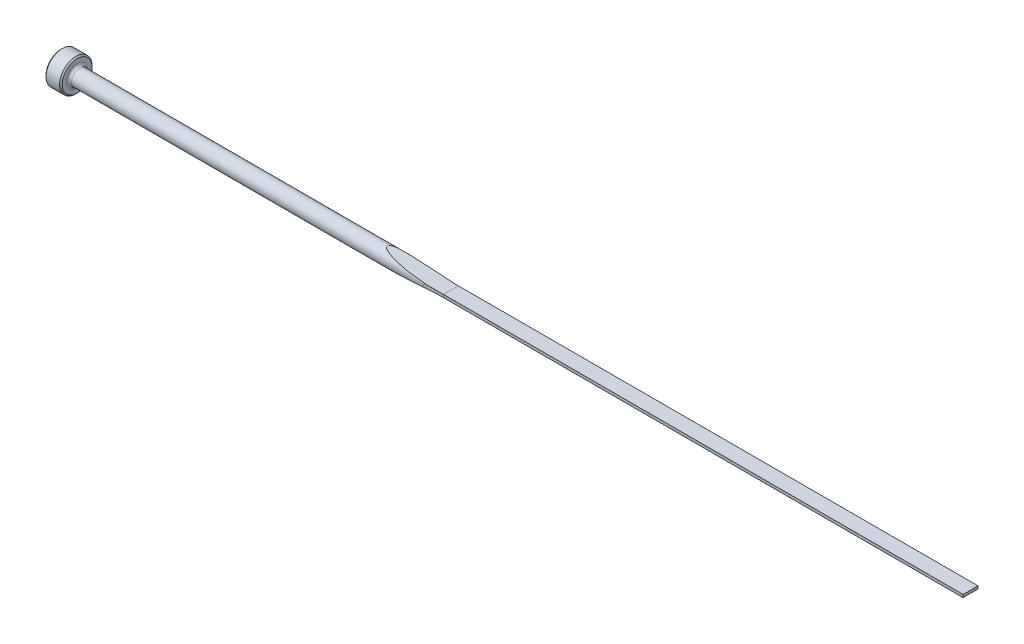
ISO-10303-21;
HEADER;
FILE_DESCRIPTION(('STEP AP214'),'2;1');
FILE_NAME('part.step','',(''),(''),'','','');
FILE_SCHEMA(('AUTOMOTIVE_DESIGN { 1 0 10303 214 1 1 1 1 }'));
ENDSEC;
DATA;
#1=APPLICATION_CONTEXT('core data for automotive mechanical design processes');
#2=APPLICATION_PROTOCOL_DEFINITION('international standard','automotive_design',2000,#1);
#3=PRODUCT_CONTEXT('',#1,'mechanical');
#4=PRODUCT('Part','Part','',(#3));
#5=PRODUCT_RELATED_PRODUCT_CATEGORY('part','',(#4));
#6=PRODUCT_DEFINITION_FORMATION('','',#4);
#7=PRODUCT_DEFINITION_CONTEXT('part definition',#1,'design');
#8=PRODUCT_DEFINITION('design','',#6,#7);
#9=PRODUCT_DEFINITION_SHAPE('','',#8);
#10=(LENGTH_UNIT() NAMED_UNIT(*) SI_UNIT(.MILLI.,.METRE.));
#11=(NAMED_UNIT(*) PLANE_ANGLE_UNIT() SI_UNIT($,.RADIAN.));
#12=(NAMED_UNIT(*) SI_UNIT($,.STERADIAN.) SOLID_ANGLE_UNIT());
#13=UNCERTAINTY_MEASURE_WITH_UNIT(LENGTH_MEASURE(1.E-05),#10,'distance_accuracy_value','');
#14=(GEOMETRIC_REPRESENTATION_CONTEXT(3) GLOBAL_UNCERTAINTY_ASSIGNED_CONTEXT((#13)) GLOBAL_UNIT_ASSIGNED_CONTEXT((#10,
#11,#12)) REPRESENTATION_CONTEXT('',''));
#15=CARTESIAN_POINT('',(0.,0.,0.));
#16=DIRECTION('',(0.,0.,1.));
#17=DIRECTION('',(1.,0.,0.));
#18=AXIS2_PLACEMENT_3D('',#15,#16,#17);
#19=CARTESIAN_POINT('',(0.,0.,0.));
#20=DIRECTION('',(-1.,0.,0.));
#21=DIRECTION('',(0.,0.,1.));
#22=AXIS2_PLACEMENT_3D('',#19,#20,#21);
#23=CYLINDRICAL_SURFACE('',#22,2.3749);
#24=CARTESIAN_POINT('',(5.5118,0.,0.));
#25=DIRECTION('',(-1.,0.,0.));
#26=DIRECTION('',(0.,0.,1.));
#27=AXIS2_PLACEMENT_3D('',#24,#25,#26);
#28=CIRCLE('',#27,2.3749);
#29=CARTESIAN_POINT('',(5.5118,0.,2.3749));
#30=VERTEX_POINT('',#29);
#31=EDGE_CURVE('E152',#30,#30,#28,.F.);
#32=ORIENTED_EDGE('',*,*,#31,.T.);
#33=EDGE_LOOP('',(#32));
#34=FACE_BOUND('',#33,.T.);
#35=CARTESIAN_POINT('',(114.3,0.931958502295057,2.18439999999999));
#36=CARTESIAN_POINT('',(114.107551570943,0.931940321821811,2.18439976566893));
#37=CARTESIAN_POINT('',(113.915101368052,0.930492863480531,2.18502490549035));
#38=CARTESIAN_POINT('',(113.530223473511,0.924611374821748,2.18752450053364));
#39=CARTESIAN_POINT('',(113.337795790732,0.920176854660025,2.18939916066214));
#40=CARTESIAN_POINT('',(112.951834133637,0.9081552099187,2.19441218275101));
#41=CARTESIAN_POINT('',(112.758300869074,0.900548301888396,2.19755847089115));
#42=CARTESIAN_POINT('',(112.371444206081,0.881895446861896,2.20511052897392));
#43=CARTESIAN_POINT('',(112.178120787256,0.87084987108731,2.20951616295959));
#44=CARTESIAN_POINT('',(111.78030053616,0.84410077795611,2.2198794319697));
#45=CARTESIAN_POINT('',(111.575821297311,0.828159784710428,2.22591363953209));
#46=CARTESIAN_POINT('',(111.167312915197,0.79103033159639,2.23937732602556));
#47=CARTESIAN_POINT('',(110.963283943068,0.7698401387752,2.24680726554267));
#48=CARTESIAN_POINT('',(110.55661740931,0.720830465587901,2.26301546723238));
#49=CARTESIAN_POINT('',(110.353977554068,0.693029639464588,2.27178991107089));
#50=CARTESIAN_POINT('',(110.051270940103,0.644172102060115,2.28592867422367));
#51=CARTESIAN_POINT('',(109.950603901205,0.626699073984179,2.29080303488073));
#52=CARTESIAN_POINT('',(109.749867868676,0.588702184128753,2.30086330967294));
#53=CARTESIAN_POINT('',(109.649798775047,0.568178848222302,2.3060491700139));
#54=CARTESIAN_POINT('',(109.501819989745,0.534634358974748,2.31396676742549));
#55=CARTESIAN_POINT('',(109.453550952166,0.523182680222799,2.31658911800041));
#56=CARTESIAN_POINT('',(109.357308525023,0.499097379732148,2.32189592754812));
#57=CARTESIAN_POINT('',(109.309335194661,0.486463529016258,2.32458039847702));
#58=CARTESIAN_POINT('',(109.166352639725,0.44658202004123,2.33269738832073));
#59=CARTESIAN_POINT('',(109.071872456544,0.417265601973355,2.33821536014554));
#60=CARTESIAN_POINT('',(108.945363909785,0.370835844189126,2.34580058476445));
#61=CARTESIAN_POINT('',(108.911833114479,0.357819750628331,2.34783049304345));
#62=CARTESIAN_POINT('',(108.845375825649,0.330089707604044,2.35189084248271));
#63=CARTESIAN_POINT('',(108.81245087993,0.315371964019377,2.35392127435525));
#64=CARTESIAN_POINT('',(108.74666492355,0.283182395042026,2.35801388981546));
#65=CARTESIAN_POINT('',(108.713839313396,0.265637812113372,2.36007502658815));
#66=CARTESIAN_POINT('',(108.650301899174,0.22709417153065,2.36409846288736));
#67=CARTESIAN_POINT('',(108.619581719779,0.206110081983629,2.36606114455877));
#68=CARTESIAN_POINT('',(108.580752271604,0.173632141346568,2.36855971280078));
#69=CARTESIAN_POINT('',(108.570653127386,0.164553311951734,2.36921145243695));
#70=CARTESIAN_POINT('',(108.551335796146,0.145453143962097,2.3704611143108));
#71=CARTESIAN_POINT('',(108.542119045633,0.135430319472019,2.3710589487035));
#72=CARTESIAN_POINT('',(108.524892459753,0.11416272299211,2.372178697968));
#73=CARTESIAN_POINT('',(108.516898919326,0.102904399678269,2.3726995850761));
#74=CARTESIAN_POINT('',(108.502963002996,0.0791761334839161,2.37360916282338));
#75=CARTESIAN_POINT('',(108.497013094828,0.0667108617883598,2.37399833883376));
#76=CARTESIAN_POINT('',(108.489549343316,0.0451214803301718,2.37448695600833));
#77=CARTESIAN_POINT('',(108.487216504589,0.0362843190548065,2.37463982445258));
#78=CARTESIAN_POINT('',(108.484070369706,0.0183429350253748,2.3748460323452));
#79=CARTESIAN_POINT('',(108.48325542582,0.00923901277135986,2.37489947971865));
#80=CARTESIAN_POINT('',(108.483239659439,-0.00898512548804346,2.37490051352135));
#81=CARTESIAN_POINT('',(108.484041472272,-0.0181053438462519,2.37484792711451));
#82=CARTESIAN_POINT('',(108.487168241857,-0.0360804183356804,2.37464298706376));
#83=CARTESIAN_POINT('',(108.489494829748,-0.0449349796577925,2.37449052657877));
#84=CARTESIAN_POINT('',(108.496426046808,-0.0650505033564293,2.37403676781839));
#85=CARTESIAN_POINT('',(108.501530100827,-0.0761364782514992,2.37370288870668));
#86=CARTESIAN_POINT('',(108.51340908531,-0.0973644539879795,2.37292722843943));
#87=CARTESIAN_POINT('',(108.520188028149,-0.10750410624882,2.3724851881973));
#88=CARTESIAN_POINT('',(108.54065261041,-0.134467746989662,2.37115359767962));
#89=CARTESIAN_POINT('',(108.555594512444,-0.150320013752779,2.37018436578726));
#90=CARTESIAN_POINT('',(108.587463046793,-0.179846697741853,2.36812651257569));
#91=CARTESIAN_POINT('',(108.604395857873,-0.193514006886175,2.36703752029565));
#92=CARTESIAN_POINT('',(108.650005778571,-0.226993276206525,2.36411848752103));
#93=CARTESIAN_POINT('',(108.679601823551,-0.245533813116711,2.36223795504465));
#94=CARTESIAN_POINT('',(108.740349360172,-0.279898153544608,2.35841043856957));
#95=CARTESIAN_POINT('',(108.771504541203,-0.295715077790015,2.35646330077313));
#96=CARTESIAN_POINT('',(108.866609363,-0.340418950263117,2.35057165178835));
#97=CARTESIAN_POINT('',(108.931917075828,-0.366382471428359,2.34659497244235));
#98=CARTESIAN_POINT('',(109.074178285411,-0.417382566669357,2.33809504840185));
#99=CARTESIAN_POINT('',(109.151384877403,-0.441669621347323,2.33358126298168));
#100=CARTESIAN_POINT('',(109.306961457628,-0.486276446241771,2.32469268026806));
#101=CARTESIAN_POINT('',(109.385331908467,-0.506594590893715,2.32031794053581));
#102=CARTESIAN_POINT('',(109.621843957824,-0.563416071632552,2.30743335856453));
#103=CARTESIAN_POINT('',(109.78100645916,-0.59566591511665,2.2991859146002));
#104=CARTESIAN_POINT('',(110.100573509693,-0.653182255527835,2.28349651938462));
#105=CARTESIAN_POINT('',(110.260978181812,-0.678448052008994,2.27605464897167));
#106=CARTESIAN_POINT('',(110.582316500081,-0.723854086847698,2.26202300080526));
#107=CARTESIAN_POINT('',(110.743249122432,-0.744001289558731,2.25543207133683));
#108=CARTESIAN_POINT('',(111.168696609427,-0.79200356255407,2.23917011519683));
#109=CARTESIAN_POINT('',(111.433609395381,-0.816543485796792,2.23022625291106));
#110=CARTESIAN_POINT('',(111.964238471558,-0.85775890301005,2.21469349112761));
#111=CARTESIAN_POINT('',(112.229955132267,-0.874429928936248,2.20810593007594));
#112=CARTESIAN_POINT('',(112.761270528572,-0.901186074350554,2.19732116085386));
#113=CARTESIAN_POINT('',(113.026868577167,-0.911283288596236,2.19311956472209));
#114=CARTESIAN_POINT('',(113.558248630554,-0.925643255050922,2.18709742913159));
#115=CARTESIAN_POINT('',(113.82403063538,-0.929906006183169,2.18527689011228));
#116=CARTESIAN_POINT('',(114.159882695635,-0.931763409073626,2.18448280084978));
#117=CARTESIAN_POINT('',(114.229941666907,-0.931956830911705,2.18439997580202));
#118=CARTESIAN_POINT('',(114.3,-0.931958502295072,2.18439999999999));
#119=B_SPLINE_CURVE_WITH_KNOTS('',3,(#35,#36,#37,#38,#39,#40,#41,#42,#43,#44,#45,#46,#47,#48,
#49,#50,#51,#52,#53,#54,#55,#56,#57,#58,#59,#60,#61,#62,#63,#64,#65,#66,#67,#68,#69,#70,#71,#72,
#73,#74,#75,#76,#77,#78,#79,#80,#81,#82,#83,#84,#85,#86,#87,#88,#89,#90,#91,#92,#93,#94,#95,#96,
#97,#98,#99,#100,#101,#102,#103,#104,#105,#106,#107,#108,#109,#110,#111,#112,#113,#114,#115,
#116,#117,#118),.UNSPECIFIED.,.F.,.F.,(4,2,2,2,2,2,2,2,2,2,2,2,2,2,2,2,2,2,2,2,2,2,2,2,2,2,2,2,
2,2,2,2,2,2,2,2,2,2,2,2,2,4),(0.,0.577341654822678,1.15477801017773,1.73587049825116,
2.31690027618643,2.93240275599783,3.54810870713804,4.16209742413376,4.46893047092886,
4.77571068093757,4.9247288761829,5.07377599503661,5.37061535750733,5.47866452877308,
5.58695943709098,5.69870175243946,5.80997010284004,5.85071283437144,5.89152080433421,
5.93283229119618,5.97398983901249,6.00129967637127,6.02857985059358,6.05590452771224,
6.08325848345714,6.11967760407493,6.15618483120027,6.22123367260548,6.2864900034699,
6.39114062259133,6.49605180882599,6.70686384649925,6.94992813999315,7.19309177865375,
7.68061293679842,8.16818297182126,8.65508602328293,9.45349626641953,10.2523593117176,
11.0497483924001,11.8471376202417,12.0573140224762),.UNSPECIFIED.);
#120=CARTESIAN_POINT('',(109.50710742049,0.535694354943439,2.31369435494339));
#121=VERTEX_POINT('',#120);
#122=CARTESIAN_POINT('',(109.50710742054,-0.535694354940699,2.31369435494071));
#123=VERTEX_POINT('',#122);
#124=EDGE_CURVE('E155',#121,#123,#119,.T.);
#125=ORIENTED_EDGE('',*,*,#124,.F.);
#126=CARTESIAN_POINT('',(114.3,0.406400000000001,2.33986945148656));
#127=CARTESIAN_POINT('',(113.904416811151,0.406399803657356,2.33984948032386));
#128=CARTESIAN_POINT('',(113.508833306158,0.409040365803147,2.33941010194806));
#129=CARTESIAN_POINT('',(112.717723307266,0.419601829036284,2.33754961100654));
#130=CARTESIAN_POINT('',(112.322196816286,0.427522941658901,2.33612845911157));
#131=CARTESIAN_POINT('',(111.530447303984,0.448666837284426,2.33215725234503));
#132=CARTESIAN_POINT('',(111.134224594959,0.461900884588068,2.32960479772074));
#133=CARTESIAN_POINT('',(110.342017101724,0.493667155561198,2.32308149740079));
#134=CARTESIAN_POINT('',(109.946032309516,0.51219918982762,2.31911070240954));
#135=CARTESIAN_POINT('',(109.15352022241,0.554602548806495,2.30933764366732));
#136=CARTESIAN_POINT('',(108.756993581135,0.578485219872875,2.30353147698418));
#137=CARTESIAN_POINT('',(107.964337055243,0.631560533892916,2.28954911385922));
#138=CARTESIAN_POINT('',(107.568207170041,0.660753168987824,2.28137292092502));
#139=CARTESIAN_POINT('',(106.776306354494,0.724449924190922,2.26195322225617));
#140=CARTESIAN_POINT('',(106.380535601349,0.758955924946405,2.25070862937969));
#141=CARTESIAN_POINT('',(105.589626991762,0.833256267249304,2.22427297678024));
#142=CARTESIAN_POINT('',(105.194489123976,0.873050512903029,2.20908198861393));
#143=CARTESIAN_POINT('',(104.405319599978,0.957870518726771,2.17364869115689));
#144=CARTESIAN_POINT('',(104.011287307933,1.00289202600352,2.15341047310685));
#145=CARTESIAN_POINT('',(103.224249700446,1.09815278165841,2.10642646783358));
#146=CARTESIAN_POINT('',(102.831244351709,1.14839185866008,2.07968089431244));
#147=CARTESIAN_POINT('',(102.046799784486,1.25399752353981,2.01777261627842));
#148=CARTESIAN_POINT('',(101.655359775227,1.30936105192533,1.98261491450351));
#149=CARTESIAN_POINT('',(101.069666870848,1.39617734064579,1.92147807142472));
#150=CARTESIAN_POINT('',(100.874692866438,1.42574258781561,1.8997007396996));
#151=CARTESIAN_POINT('',(100.485332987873,1.48610747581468,1.85286228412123));
#152=CARTESIAN_POINT('',(100.290947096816,1.51690708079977,1.82780125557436));
#153=CARTESIAN_POINT('',(99.9027972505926,1.57972659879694,1.77379004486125));
#154=CARTESIAN_POINT('',(99.7090337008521,1.61174718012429,1.74483771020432));
#155=CARTESIAN_POINT('',(99.3224234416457,1.67694930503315,1.68227119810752));
#156=CARTESIAN_POINT('',(99.1295768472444,1.71013099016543,1.64865645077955));
#157=CARTESIAN_POINT('',(98.7454982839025,1.77751664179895,1.57576815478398));
#158=CARTESIAN_POINT('',(98.5542640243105,1.81171864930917,1.53650495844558));
#159=CARTESIAN_POINT('',(98.1736080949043,1.88107830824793,1.45077652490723));
#160=CARTESIAN_POINT('',(97.9841859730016,1.91623571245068,1.40431313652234));
#161=CARTESIAN_POINT('',(97.6545415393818,1.9785150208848,1.3144663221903));
#162=CARTESIAN_POINT('',(97.5137260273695,2.00547620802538,1.27315803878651));
#163=CARTESIAN_POINT('',(97.2340568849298,2.05971596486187,1.18342755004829));
#164=CARTESIAN_POINT('',(97.0952077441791,2.08699506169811,1.1349912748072));
#165=CARTESIAN_POINT('',(96.8903441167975,2.12774040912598,1.05533759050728));
#166=CARTESIAN_POINT('',(96.8229205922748,2.14123294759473,1.02775945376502));
#167=CARTESIAN_POINT('',(96.6893070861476,2.16812981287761,0.969737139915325));
#168=CARTESIAN_POINT('',(96.6231168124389,2.18153416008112,0.939293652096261));
#169=CARTESIAN_POINT('',(96.4926184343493,2.20811308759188,0.874982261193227));
#170=CARTESIAN_POINT('',(96.4283052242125,2.22128824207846,0.84112503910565));
#171=CARTESIAN_POINT('',(96.3021420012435,2.24727503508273,0.769012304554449));
#172=CARTESIAN_POINT('',(96.2402897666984,2.26008699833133,0.73076088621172));
#173=CARTESIAN_POINT('',(96.1403180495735,2.28090012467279,0.662165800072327));
#174=CARTESIAN_POINT('',(96.1011456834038,2.28908441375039,0.63342184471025));
#175=CARTESIAN_POINT('',(96.0251269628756,2.30501770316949,0.572739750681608));
#176=CARTESIAN_POINT('',(95.9882839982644,2.31276606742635,0.540797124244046));
#177=CARTESIAN_POINT('',(95.9177924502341,2.32763389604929,0.472755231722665));
#178=CARTESIAN_POINT('',(95.8841755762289,2.33474707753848,0.436621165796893));
#179=CARTESIAN_POINT('',(95.822498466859,2.34782984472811,0.359666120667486));
#180=CARTESIAN_POINT('',(95.7944234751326,2.35380246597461,0.318858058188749));
#181=CARTESIAN_POINT('',(95.7557647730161,2.3620409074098,0.248316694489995));
#182=CARTESIAN_POINT('',(95.742557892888,2.3648594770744,0.220101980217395));
#183=CARTESIAN_POINT('',(95.7205811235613,2.36955326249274,0.161913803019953));
#184=CARTESIAN_POINT('',(95.7118054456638,2.37142970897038,0.131942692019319));
#185=CARTESIAN_POINT('',(95.6995504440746,2.37405090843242,0.0705758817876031));
#186=CARTESIAN_POINT('',(95.696118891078,2.3747854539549,0.0391698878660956));
#187=CARTESIAN_POINT('',(95.6951655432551,2.37498947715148,-0.0237379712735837));
#188=CARTESIAN_POINT('',(95.6976430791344,2.37445909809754,-0.0552398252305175));
#189=CARTESIAN_POINT('',(95.7076355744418,2.37232149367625,-0.114120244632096));
#190=CARTESIAN_POINT('',(95.7146229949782,2.37082704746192,-0.141596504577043));
#191=CARTESIAN_POINT('',(95.7324513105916,2.36701756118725,-0.195194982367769));
#192=CARTESIAN_POINT('',(95.7432944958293,2.3647020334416,-0.221316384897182));
#193=CARTESIAN_POINT('',(95.775995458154,2.35772732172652,-0.288121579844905));
#194=CARTESIAN_POINT('',(95.8004661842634,2.35251555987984,-0.327458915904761));
#195=CARTESIAN_POINT('',(95.8549219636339,2.34094780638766,-0.401925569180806));
#196=CARTESIAN_POINT('',(95.8849249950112,2.33458808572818,-0.437040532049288));
#197=CARTESIAN_POINT('',(95.9478725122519,2.32128385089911,-0.502883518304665));
#198=CARTESIAN_POINT('',(95.9807403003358,2.31435476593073,-0.533689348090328));
#199=CARTESIAN_POINT('',(96.0489037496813,2.3000283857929,-0.592395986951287));
#200=CARTESIAN_POINT('',(96.084201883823,2.29263061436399,-0.620293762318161));
#201=CARTESIAN_POINT('',(96.1565971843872,2.27750649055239,-0.673710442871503));
#202=CARTESIAN_POINT('',(96.1936982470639,2.26977943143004,-0.699223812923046));
#203=CARTESIAN_POINT('',(96.2691612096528,2.25411491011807,-0.748180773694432));
#204=CARTESIAN_POINT('',(96.3075225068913,2.24617754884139,-0.771625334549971));
#205=CARTESIAN_POINT('',(96.4136713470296,2.22428956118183,-0.833316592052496));
#206=CARTESIAN_POINT('',(96.4824349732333,2.21019214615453,-0.869829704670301));
#207=CARTESIAN_POINT('',(96.6219229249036,2.18177272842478,-0.938828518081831));
#208=CARTESIAN_POINT('',(96.6926484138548,2.1674505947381,-0.971311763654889));
#209=CARTESIAN_POINT('',(96.9071388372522,2.12429388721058,-1.06406057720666));
#210=CARTESIAN_POINT('',(97.052962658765,2.0953216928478,-1.11948666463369));
#211=CARTESIAN_POINT('',(97.3483943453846,2.0374140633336,-1.22168715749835));
#212=CARTESIAN_POINT('',(97.4980180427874,2.00847961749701,-1.26841467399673));
#213=CARTESIAN_POINT('',(97.7238574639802,1.96541667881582,-1.33339980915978));
#214=CARTESIAN_POINT('',(97.7993227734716,1.95112780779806,-1.35419888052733));
#215=CARTESIAN_POINT('',(97.9506704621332,1.92267524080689,-1.39430070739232));
#216=CARTESIAN_POINT('',(98.0265528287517,1.90851154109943,-1.41360350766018));
#217=CARTESIAN_POINT('',(98.2813454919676,1.86129873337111,-1.47605728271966));
#218=CARTESIAN_POINT('',(98.4610488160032,1.82856748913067,-1.51622419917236));
#219=CARTESIAN_POINT('',(98.821807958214,1.76401499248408,-1.59085660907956));
#220=CARTESIAN_POINT('',(99.0028640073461,1.73219390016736,-1.62532110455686));
#221=CARTESIAN_POINT('',(99.3660633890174,1.66952697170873,-1.68962914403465));
#222=CARTESIAN_POINT('',(99.5482072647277,1.6386816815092,-1.71947013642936));
#223=CARTESIAN_POINT('',(99.9132627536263,1.57803492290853,-1.7752879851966));
#224=CARTESIAN_POINT('',(100.096174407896,1.54823351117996,-1.80126463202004));
#225=CARTESIAN_POINT('',(100.64671861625,1.46030598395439,-1.87443797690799));
#226=CARTESIAN_POINT('',(101.015266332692,1.40381094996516,-1.91672647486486));
#227=CARTESIAN_POINT('',(101.753854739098,1.29535770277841,-1.99160931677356));
#228=CARTESIAN_POINT('',(102.123894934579,1.24339809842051,-2.02420664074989));
#229=CARTESIAN_POINT('',(102.865108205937,1.1440892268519,-2.08194780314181));
#230=CARTESIAN_POINT('',(103.236281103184,1.09673926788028,-2.10709276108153));
#231=CARTESIAN_POINT('',(103.979558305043,1.00669079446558,-2.15156688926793));
#232=CARTESIAN_POINT('',(104.351662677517,0.963992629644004,-2.17089562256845));
#233=CARTESIAN_POINT('',(105.096097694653,0.883336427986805,-2.20494434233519));
#234=CARTESIAN_POINT('',(105.468427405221,0.845372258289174,-2.21967032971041));
#235=CARTESIAN_POINT('',(106.213662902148,0.774138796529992,-2.24550424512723));
#236=CARTESIAN_POINT('',(106.586568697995,0.740869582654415,-2.25661211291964));
#237=CARTESIAN_POINT('',(107.560012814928,0.660219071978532,-2.28188501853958));
#238=CARTESIAN_POINT('',(108.160922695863,0.616576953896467,-2.29379434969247));
#239=CARTESIAN_POINT('',(109.363741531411,0.541505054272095,-2.31266265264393));
#240=CARTESIAN_POINT('',(109.965650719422,0.510078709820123,-2.31962023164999));
#241=CARTESIAN_POINT('',(111.169258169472,0.459504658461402,-2.33016558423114));
#242=CARTESIAN_POINT('',(111.770955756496,0.440341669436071,-2.33375755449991));
#243=CARTESIAN_POINT('',(112.974620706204,0.414242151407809,-2.33853166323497));
#244=CARTESIAN_POINT('',(113.576588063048,0.40730536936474,-2.33971385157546));
#245=CARTESIAN_POINT('',(114.219031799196,0.406427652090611,-2.3398645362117));
#246=CARTESIAN_POINT('',(114.259515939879,0.406399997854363,-2.3398693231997));
#247=CARTESIAN_POINT('',(114.3,0.406399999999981,-2.33986945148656));
#248=B_SPLINE_CURVE_WITH_KNOTS('',3,(#126,#127,#128,#129,#130,#131,#132,#133,#134,#135,#136,
#137,#138,#139,#140,#141,#142,#143,#144,#145,#146,#147,#148,#149,#150,#151,#152,#153,#154,#155,
#156,#157,#158,#159,#160,#161,#162,#163,#164,#165,#166,#167,#168,#169,#170,#171,#172,#173,#174,
#175,#176,#177,#178,#179,#180,#181,#182,#183,#184,#185,#186,#187,#188,#189,#190,#191,#192,#193,
#194,#195,#196,#197,#198,#199,#200,#201,#202,#203,#204,#205,#206,#207,#208,#209,#210,#211,#212,
#213,#214,#215,#216,#217,#218,#219,#220,#221,#222,#223,#224,#225,#226,#227,#228,#229,#230,#231,
#232,#233,#234,#235,#236,#237,#238,#239,#240,#241,#242,#243,#244,#245,#246,#247),.UNSPECIFIED.,
.F.,.F.,(4,2,2,2,2,2,2,2,2,2,2,2,2,2,2,2,2,2,2,2,2,2,2,2,2,2,2,2,2,2,2,2,2,2,2,2,2,2,2,2,2,2,2,
2,2,2,2,2,2,2,2,2,2,2,2,2,2,2,2,2,4),(0.,1.18674101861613,2.3735295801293,3.56284773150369,
4.75212337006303,5.94394522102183,7.13576530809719,8.328008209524,9.52022949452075,
10.7114874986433,11.9027063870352,13.0932186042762,13.6883984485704,14.2835610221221,
14.8790541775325,15.4746201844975,16.0691082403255,16.6634438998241,17.1109425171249,
17.5593366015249,17.781541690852,18.0036934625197,18.2251705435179,18.4464429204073,
18.5941408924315,18.7420490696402,18.8912874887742,19.0401230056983,19.1336595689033,
19.2270736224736,19.3213179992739,19.4155517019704,19.5003787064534,19.5852561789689,
19.7243067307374,19.8638173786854,20.0003421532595,20.1370079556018,20.2739835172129,
20.4108945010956,20.6480705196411,20.8853903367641,21.3609114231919,21.8389259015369,
22.077629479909,22.3163259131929,22.8772603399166,23.4382928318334,23.9996338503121,
24.5610052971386,25.6865059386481,26.8116601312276,27.9366452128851,29.0617147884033,
30.1853113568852,31.3089266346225,33.1165903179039,34.9247622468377,36.7306764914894,
38.5365533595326,38.658005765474),.UNSPECIFIED.);
#249=CARTESIAN_POINT('',(109.50710742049,0.53569435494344,-2.31369435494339));
#250=VERTEX_POINT('',#249);
#251=EDGE_CURVE('E105',#121,#250,#248,.T.);
#252=ORIENTED_EDGE('',*,*,#251,.T.);
#253=CARTESIAN_POINT('',(114.3,0.931958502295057,-2.18439999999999));
#254=CARTESIAN_POINT('',(114.107551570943,0.9319403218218,-2.18439976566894));
#255=CARTESIAN_POINT('',(113.915101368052,0.930492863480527,-2.18502490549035));
#256=CARTESIAN_POINT('',(113.530223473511,0.924611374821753,-2.18752450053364));
#257=CARTESIAN_POINT('',(113.337795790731,0.920176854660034,-2.18939916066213));
#258=CARTESIAN_POINT('',(112.951834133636,0.908155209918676,-2.19441218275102));
#259=CARTESIAN_POINT('',(112.758300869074,0.900548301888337,-2.19755847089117));
#260=CARTESIAN_POINT('',(112.37144420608,0.881895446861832,-2.20511052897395));
#261=CARTESIAN_POINT('',(112.178120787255,0.870849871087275,-2.20951616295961));
#262=CARTESIAN_POINT('',(111.780300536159,0.844100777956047,-2.21987943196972));
#263=CARTESIAN_POINT('',(111.57582129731,0.828159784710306,-2.22591363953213));
#264=CARTESIAN_POINT('',(111.167312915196,0.791030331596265,-2.23937732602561));
#265=CARTESIAN_POINT('',(110.963283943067,0.769840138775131,-2.24680726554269));
#266=CARTESIAN_POINT('',(110.55661740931,0.720830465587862,-2.26301546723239));
#267=CARTESIAN_POINT('',(110.353977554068,0.693029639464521,-2.2717899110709));
#268=CARTESIAN_POINT('',(110.051270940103,0.644172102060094,-2.28592867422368));
#269=CARTESIAN_POINT('',(109.950603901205,0.626699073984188,-2.29080303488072));
#270=CARTESIAN_POINT('',(109.749867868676,0.588702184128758,-2.30086330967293));
#271=CARTESIAN_POINT('',(109.649798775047,0.568178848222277,-2.30604917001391));
#272=CARTESIAN_POINT('',(109.501819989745,0.534634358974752,-2.31396676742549));
#273=CARTESIAN_POINT('',(109.453550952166,0.523182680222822,-2.31658911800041));
#274=CARTESIAN_POINT('',(109.357308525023,0.499097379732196,-2.32189592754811));
#275=CARTESIAN_POINT('',(109.309335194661,0.486463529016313,-2.32458039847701));
#276=CARTESIAN_POINT('',(109.166352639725,0.446582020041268,-2.33269738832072));
#277=CARTESIAN_POINT('',(109.071872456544,0.417265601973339,-2.33821536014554));
#278=CARTESIAN_POINT('',(108.945363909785,0.370835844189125,-2.34580058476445));
#279=CARTESIAN_POINT('',(108.911833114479,0.357819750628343,-2.34783049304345));
#280=CARTESIAN_POINT('',(108.845375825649,0.330089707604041,-2.35189084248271));
#281=CARTESIAN_POINT('',(108.81245087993,0.315371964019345,-2.35392127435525));
#282=CARTESIAN_POINT('',(108.74666492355,0.283182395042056,-2.35801388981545));
#283=CARTESIAN_POINT('',(108.713839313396,0.265637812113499,-2.36007502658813));
#284=CARTESIAN_POINT('',(108.650301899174,0.227094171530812,-2.36409846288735));
#285=CARTESIAN_POINT('',(108.619581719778,0.206110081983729,-2.36606114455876));
#286=CARTESIAN_POINT('',(108.580752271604,0.173632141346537,-2.36855971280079));
#287=CARTESIAN_POINT('',(108.570653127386,0.164553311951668,-2.36921145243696));
#288=CARTESIAN_POINT('',(108.551335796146,0.145453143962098,-2.3704611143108));
#289=CARTESIAN_POINT('',(108.542119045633,0.135430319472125,-2.37105894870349));
#290=CARTESIAN_POINT('',(108.524892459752,0.114162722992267,-2.37217869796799));
#291=CARTESIAN_POINT('',(108.516898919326,0.102904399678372,-2.37269958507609));
#292=CARTESIAN_POINT('',(108.502963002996,0.0791761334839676,-2.37360916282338));
#293=CARTESIAN_POINT('',(108.497013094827,0.0667108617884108,-2.37399833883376));
#294=CARTESIAN_POINT('',(108.489549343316,0.0451214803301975,-2.37448695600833));
#295=CARTESIAN_POINT('',(108.487216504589,0.036284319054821,-2.37463982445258));
#296=CARTESIAN_POINT('',(108.484070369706,0.0183429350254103,-2.3748460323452));
#297=CARTESIAN_POINT('',(108.48325542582,0.00923901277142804,-2.37489947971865));
#298=CARTESIAN_POINT('',(108.483239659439,-0.00898512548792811,-2.37490051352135));
#299=CARTESIAN_POINT('',(108.484041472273,-0.0181053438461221,-2.37484792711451));
#300=CARTESIAN_POINT('',(108.487168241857,-0.0360804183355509,-2.37464298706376));
#301=CARTESIAN_POINT('',(108.489494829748,-0.0449349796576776,-2.37449052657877));
#302=CARTESIAN_POINT('',(108.496426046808,-0.0650505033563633,-2.37403676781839));
#303=CARTESIAN_POINT('',(108.501530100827,-0.0761364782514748,-2.37370288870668));
#304=CARTESIAN_POINT('',(108.51340908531,-0.0973644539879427,-2.37292722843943));
#305=CARTESIAN_POINT('',(108.520188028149,-0.10750410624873,-2.37248518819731));
#306=CARTESIAN_POINT('',(108.54065261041,-0.13446774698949,-2.37115359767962));
#307=CARTESIAN_POINT('',(108.555594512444,-0.150320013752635,-2.37018436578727));
#308=CARTESIAN_POINT('',(108.587463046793,-0.179846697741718,-2.3681265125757));
#309=CARTESIAN_POINT('',(108.604395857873,-0.193514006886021,-2.36703752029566));
#310=CARTESIAN_POINT('',(108.65000577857,-0.226993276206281,-2.36411848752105));
#311=CARTESIAN_POINT('',(108.679601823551,-0.245533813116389,-2.36223795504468));
#312=CARTESIAN_POINT('',(108.740349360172,-0.279898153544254,-2.35841043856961));
#313=CARTESIAN_POINT('',(108.771504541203,-0.295715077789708,-2.35646330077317));
#314=CARTESIAN_POINT('',(108.866609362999,-0.340418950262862,-2.35057165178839));
#315=CARTESIAN_POINT('',(108.931917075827,-0.366382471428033,-2.3465949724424));
#316=CARTESIAN_POINT('',(109.07417828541,-0.417382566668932,-2.33809504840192));
#317=CARTESIAN_POINT('',(109.151384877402,-0.441669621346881,-2.33358126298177));
#318=CARTESIAN_POINT('',(109.306961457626,-0.486276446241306,-2.32469268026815));
#319=CARTESIAN_POINT('',(109.385331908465,-0.506594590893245,-2.32031794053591));
#320=CARTESIAN_POINT('',(109.621843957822,-0.56341607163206,-2.30743335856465));
#321=CARTESIAN_POINT('',(109.781006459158,-0.595665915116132,-2.29918591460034));
#322=CARTESIAN_POINT('',(110.10057350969,-0.653182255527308,-2.28349651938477));
#323=CARTESIAN_POINT('',(110.260978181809,-0.678448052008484,-2.27605464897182));
#324=CARTESIAN_POINT('',(110.582316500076,-0.723854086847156,-2.26202300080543));
#325=CARTESIAN_POINT('',(110.743249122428,-0.744001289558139,-2.25543207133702));
#326=CARTESIAN_POINT('',(111.168696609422,-0.792003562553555,-2.23917011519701));
#327=CARTESIAN_POINT('',(111.433609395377,-0.816543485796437,-2.23022625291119));
#328=CARTESIAN_POINT('',(111.964238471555,-0.857758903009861,-2.21469349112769));
#329=CARTESIAN_POINT('',(112.229955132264,-0.874429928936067,-2.20810593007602));
#330=CARTESIAN_POINT('',(112.761270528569,-0.901186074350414,-2.19732116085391));
#331=CARTESIAN_POINT('',(113.026868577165,-0.911283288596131,-2.19311956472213));
#332=CARTESIAN_POINT('',(113.558248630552,-0.92564325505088,-2.1870974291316));
#333=CARTESIAN_POINT('',(113.824030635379,-0.929906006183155,-2.18527689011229));
#334=CARTESIAN_POINT('',(114.159882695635,-0.931763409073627,-2.18448280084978));
#335=CARTESIAN_POINT('',(114.229941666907,-0.931956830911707,-2.18439997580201));
#336=CARTESIAN_POINT('',(114.3,-0.931958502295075,-2.18439999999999));
#337=B_SPLINE_CURVE_WITH_KNOTS('',3,(#253,#254,#255,#256,#257,#258,#259,#260,#261,#262,#263,
#264,#265,#266,#267,#268,#269,#270,#271,#272,#273,#274,#275,#276,#277,#278,#279,#280,#281,#282,
#283,#284,#285,#286,#287,#288,#289,#290,#291,#292,#293,#294,#295,#296,#297,#298,#299,#300,#301,
#302,#303,#304,#305,#306,#307,#308,#309,#310,#311,#312,#313,#314,#315,#316,#317,#318,#319,#320,
#321,#322,#323,#324,#325,#326,#327,#328,#329,#330,#331,#332,#333,#334,#335,#336),.UNSPECIFIED.,
.F.,.F.,(4,2,2,2,2,2,2,2,2,2,2,2,2,2,2,2,2,2,2,2,2,2,2,2,2,2,2,2,2,2,2,2,2,2,2,2,2,2,2,2,2,4),
(0.,0.577341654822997,1.15477801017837,1.73587049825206,2.31690027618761,2.93240275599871,
3.54810870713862,4.16209742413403,4.46893047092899,4.77571068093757,4.92472887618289,
5.07377599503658,5.37061535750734,5.47866452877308,5.58695943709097,5.6987017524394,
5.80997010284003,5.85071283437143,5.89152080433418,5.93283229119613,5.97398983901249,
6.00129967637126,6.02857985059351,6.05590452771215,6.08325848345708,6.11967760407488,
6.15618483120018,6.22123367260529,6.28649000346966,6.3911406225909,6.49605180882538,
6.70686384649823,6.94992813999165,7.19309177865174,7.68061293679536,8.16818297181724,
8.65508602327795,9.45349626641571,10.2523593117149,11.0497483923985,11.8471376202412,
12.0573140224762),.UNSPECIFIED.);
#338=CARTESIAN_POINT('',(109.50710742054,-0.535694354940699,-2.31369435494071));
#339=VERTEX_POINT('',#338);
#340=EDGE_CURVE('E174',#250,#339,#337,.T.);
#341=ORIENTED_EDGE('',*,*,#340,.T.);
#342=CARTESIAN_POINT('',(114.3,-0.406400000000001,2.33986945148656));
#343=CARTESIAN_POINT('',(113.904416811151,-0.406399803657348,2.33984948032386));
#344=CARTESIAN_POINT('',(113.508833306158,-0.409040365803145,2.33941010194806));
#345=CARTESIAN_POINT('',(112.717723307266,-0.419601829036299,2.33754961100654));
#346=CARTESIAN_POINT('',(112.322196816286,-0.427522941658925,2.33612845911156));
#347=CARTESIAN_POINT('',(111.530447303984,-0.448666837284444,2.33215725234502));
#348=CARTESIAN_POINT('',(111.134224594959,-0.461900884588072,2.32960479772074));
#349=CARTESIAN_POINT('',(110.342017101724,-0.493667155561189,2.32308149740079));
#350=CARTESIAN_POINT('',(109.946032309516,-0.512199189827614,2.31911070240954));
#351=CARTESIAN_POINT('',(109.15352022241,-0.5546025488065,2.30933764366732));
#352=CARTESIAN_POINT('',(108.756993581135,-0.578485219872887,2.30353147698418));
#353=CARTESIAN_POINT('',(107.964337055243,-0.631560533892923,2.28954911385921));
#354=CARTESIAN_POINT('',(107.568207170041,-0.660753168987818,2.28137292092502));
#355=CARTESIAN_POINT('',(106.776306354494,-0.724449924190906,2.26195322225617));
#356=CARTESIAN_POINT('',(106.380535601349,-0.758955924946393,2.2507086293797));
#357=CARTESIAN_POINT('',(105.589626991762,-0.833256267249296,2.22427297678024));
#358=CARTESIAN_POINT('',(105.194489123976,-0.87305051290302,2.20908198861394));
#359=CARTESIAN_POINT('',(104.405319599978,-0.957870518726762,2.1736486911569));
#360=CARTESIAN_POINT('',(104.011287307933,-1.00289202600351,2.15341047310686));
#361=CARTESIAN_POINT('',(103.224249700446,-1.0981527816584,2.10642646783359));
#362=CARTESIAN_POINT('',(102.831244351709,-1.14839185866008,2.07968089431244));
#363=CARTESIAN_POINT('',(102.046799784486,-1.25399752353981,2.01777261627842));
#364=CARTESIAN_POINT('',(101.655359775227,-1.30936105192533,1.98261491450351));
#365=CARTESIAN_POINT('',(101.069666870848,-1.39617734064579,1.92147807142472));
#366=CARTESIAN_POINT('',(100.874692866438,-1.42574258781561,1.89970073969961));
#367=CARTESIAN_POINT('',(100.485332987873,-1.48610747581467,1.85286228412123));
#368=CARTESIAN_POINT('',(100.290947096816,-1.51690708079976,1.82780125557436));
#369=CARTESIAN_POINT('',(99.9027972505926,-1.57972659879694,1.77379004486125));
#370=CARTESIAN_POINT('',(99.7090337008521,-1.61174718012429,1.74483771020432));
#371=CARTESIAN_POINT('',(99.3224234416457,-1.67694930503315,1.68227119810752));
#372=CARTESIAN_POINT('',(99.1295768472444,-1.71013099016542,1.64865645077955));
#373=CARTESIAN_POINT('',(98.7454982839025,-1.77751664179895,1.57576815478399));
#374=CARTESIAN_POINT('',(98.5542640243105,-1.81171864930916,1.53650495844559));
#375=CARTESIAN_POINT('',(98.1736080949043,-1.88107830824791,1.45077652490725));
#376=CARTESIAN_POINT('',(97.9841859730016,-1.91623571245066,1.40431313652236));
#377=CARTESIAN_POINT('',(97.6545415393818,-1.97851502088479,1.31446632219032));
#378=CARTESIAN_POINT('',(97.5137260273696,-2.00547620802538,1.27315803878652));
#379=CARTESIAN_POINT('',(97.2340568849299,-2.05971596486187,1.18342755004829));
#380=CARTESIAN_POINT('',(97.0952077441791,-2.08699506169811,1.1349912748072));
#381=CARTESIAN_POINT('',(96.8903441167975,-2.12774040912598,1.05533759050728));
#382=CARTESIAN_POINT('',(96.8229205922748,-2.14123294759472,1.02775945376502));
#383=CARTESIAN_POINT('',(96.6893070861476,-2.16812981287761,0.969737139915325));
#384=CARTESIAN_POINT('',(96.6231168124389,-2.18153416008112,0.939293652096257));
#385=CARTESIAN_POINT('',(96.4926184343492,-2.20811308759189,0.874982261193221));
#386=CARTESIAN_POINT('',(96.4283052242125,-2.22128824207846,0.841125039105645));
#387=CARTESIAN_POINT('',(96.3021420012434,-2.24727503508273,0.76901230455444));
#388=CARTESIAN_POINT('',(96.2402897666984,-2.26008699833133,0.730760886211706));
#389=CARTESIAN_POINT('',(96.1403180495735,-2.2809001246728,0.662165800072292));
#390=CARTESIAN_POINT('',(96.1011456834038,-2.2890844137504,0.633421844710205));
#391=CARTESIAN_POINT('',(96.0251269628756,-2.30501770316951,0.57273975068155));
#392=CARTESIAN_POINT('',(95.9882839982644,-2.31276606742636,0.540797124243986));
#393=CARTESIAN_POINT('',(95.9177924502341,-2.3276338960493,0.472755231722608));
#394=CARTESIAN_POINT('',(95.8841755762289,-2.33474707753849,0.436621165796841));
#395=CARTESIAN_POINT('',(95.822498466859,-2.34782984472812,0.359666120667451));
#396=CARTESIAN_POINT('',(95.7944234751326,-2.35380246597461,0.318858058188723));
#397=CARTESIAN_POINT('',(95.755764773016,-2.3620409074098,0.248316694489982));
#398=CARTESIAN_POINT('',(95.7425578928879,-2.3648594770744,0.220101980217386));
#399=CARTESIAN_POINT('',(95.7205811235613,-2.36955326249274,0.161913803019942));
#400=CARTESIAN_POINT('',(95.7118054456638,-2.37142970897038,0.131942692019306));
#401=CARTESIAN_POINT('',(95.6995504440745,-2.37405090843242,0.0705758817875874));
#402=CARTESIAN_POINT('',(95.696118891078,-2.3747854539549,0.0391698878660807));
#403=CARTESIAN_POINT('',(95.695165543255,-2.37498947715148,-0.0237379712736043));
#404=CARTESIAN_POINT('',(95.6976430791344,-2.37445909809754,-0.0552398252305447));
#405=CARTESIAN_POINT('',(95.7076355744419,-2.37232149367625,-0.114120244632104));
#406=CARTESIAN_POINT('',(95.7146229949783,-2.37082704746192,-0.141596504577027));
#407=CARTESIAN_POINT('',(95.7324513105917,-2.36701756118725,-0.195194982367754));
#408=CARTESIAN_POINT('',(95.7432944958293,-2.3647020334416,-0.221316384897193));
#409=CARTESIAN_POINT('',(95.7759954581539,-2.35772732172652,-0.288121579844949));
#410=CARTESIAN_POINT('',(95.8004661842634,-2.35251555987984,-0.327458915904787));
#411=CARTESIAN_POINT('',(95.854921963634,-2.34094780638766,-0.401925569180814));
#412=CARTESIAN_POINT('',(95.8849249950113,-2.33458808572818,-0.437040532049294));
#413=CARTESIAN_POINT('',(95.9478725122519,-2.32128385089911,-0.502883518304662));
#414=CARTESIAN_POINT('',(95.9807403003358,-2.31435476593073,-0.533689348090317));
#415=CARTESIAN_POINT('',(96.0489037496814,-2.3000283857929,-0.592395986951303));
#416=CARTESIAN_POINT('',(96.084201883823,-2.29263061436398,-0.620293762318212));
#417=CARTESIAN_POINT('',(96.1565971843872,-2.27750649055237,-0.673710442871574));
#418=CARTESIAN_POINT('',(96.1936982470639,-2.26977943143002,-0.699223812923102));
#419=CARTESIAN_POINT('',(96.2691612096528,-2.25411491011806,-0.748180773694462));
#420=CARTESIAN_POINT('',(96.3075225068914,-2.24617754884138,-0.771625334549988));
#421=CARTESIAN_POINT('',(96.4136713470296,-2.22428956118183,-0.833316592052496));
#422=CARTESIAN_POINT('',(96.4824349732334,-2.21019214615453,-0.869829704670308));
#423=CARTESIAN_POINT('',(96.6219229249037,-2.18177272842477,-0.938828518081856));
#424=CARTESIAN_POINT('',(96.6926484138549,-2.16745059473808,-0.971311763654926));
#425=CARTESIAN_POINT('',(96.9071388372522,-2.12429388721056,-1.0640605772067));
#426=CARTESIAN_POINT('',(97.0529626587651,-2.09532169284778,-1.11948666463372));
#427=CARTESIAN_POINT('',(97.3483943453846,-2.0374140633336,-1.22168715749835));
#428=CARTESIAN_POINT('',(97.4980180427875,-2.00847961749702,-1.26841467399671));
#429=CARTESIAN_POINT('',(97.7238574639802,-1.96541667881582,-1.33339980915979));
#430=CARTESIAN_POINT('',(97.7993227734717,-1.95112780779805,-1.35419888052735));
#431=CARTESIAN_POINT('',(97.9506704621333,-1.92267524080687,-1.39430070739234));
#432=CARTESIAN_POINT('',(98.0265528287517,-1.90851154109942,-1.41360350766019));
#433=CARTESIAN_POINT('',(98.2813454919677,-1.86129873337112,-1.47605728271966));
#434=CARTESIAN_POINT('',(98.4610488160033,-1.82856748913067,-1.51622419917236));
#435=CARTESIAN_POINT('',(98.8218079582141,-1.76401499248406,-1.59085660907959));
#436=CARTESIAN_POINT('',(99.0028640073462,-1.73219390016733,-1.6253211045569));
#437=CARTESIAN_POINT('',(99.3660633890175,-1.66952697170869,-1.68962914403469));
#438=CARTESIAN_POINT('',(99.5482072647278,-1.63868168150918,-1.71947013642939));
#439=CARTESIAN_POINT('',(99.9132627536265,-1.57803492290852,-1.77528798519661));
#440=CARTESIAN_POINT('',(100.096174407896,-1.54823351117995,-1.80126463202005));
#441=CARTESIAN_POINT('',(100.64671861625,-1.46030598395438,-1.874437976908));
#442=CARTESIAN_POINT('',(101.015266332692,-1.40381094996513,-1.91672647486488));
#443=CARTESIAN_POINT('',(101.753854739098,-1.29535770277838,-1.99160931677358));
#444=CARTESIAN_POINT('',(102.123894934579,-1.24339809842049,-2.02420664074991));
#445=CARTESIAN_POINT('',(102.865108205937,-1.14408922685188,-2.08194780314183));
#446=CARTESIAN_POINT('',(103.236281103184,-1.09673926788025,-2.10709276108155));
#447=CARTESIAN_POINT('',(103.979558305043,-1.00669079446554,-2.15156688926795));
#448=CARTESIAN_POINT('',(104.351662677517,-0.963992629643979,-2.17089562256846));
#449=CARTESIAN_POINT('',(105.096097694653,-0.883336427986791,-2.20494434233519));
#450=CARTESIAN_POINT('',(105.468427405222,-0.84537225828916,-2.21967032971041));
#451=CARTESIAN_POINT('',(106.213662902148,-0.774138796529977,-2.24550424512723));
#452=CARTESIAN_POINT('',(106.586568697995,-0.740869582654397,-2.25661211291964));
#453=CARTESIAN_POINT('',(107.560012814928,-0.660219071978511,-2.28188501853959));
#454=CARTESIAN_POINT('',(108.160922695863,-0.616576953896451,-2.29379434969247));
#455=CARTESIAN_POINT('',(109.363741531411,-0.54150505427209,-2.31266265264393));
#456=CARTESIAN_POINT('',(109.965650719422,-0.510078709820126,-2.31962023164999));
#457=CARTESIAN_POINT('',(111.169258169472,-0.459504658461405,-2.33016558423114));
#458=CARTESIAN_POINT('',(111.770955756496,-0.440341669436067,-2.33375755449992));
#459=CARTESIAN_POINT('',(112.974620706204,-0.41424215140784,-2.33853166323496));
#460=CARTESIAN_POINT('',(113.576588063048,-0.407305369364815,-2.33971385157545));
#461=CARTESIAN_POINT('',(114.219031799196,-0.40642765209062,-2.3398645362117));
#462=CARTESIAN_POINT('',(114.259515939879,-0.406399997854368,-2.3398693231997));
#463=CARTESIAN_POINT('',(114.3,-0.406399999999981,-2.33986945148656));
#464=B_SPLINE_CURVE_WITH_KNOTS('',3,(#342,#343,#344,#345,#346,#347,#348,#349,#350,#351,#352,
#353,#354,#355,#356,#357,#358,#359,#360,#361,#362,#363,#364,#365,#366,#367,#368,#369,#370,#371,
#372,#373,#374,#375,#376,#377,#378,#379,#380,#381,#382,#383,#384,#385,#386,#387,#388,#389,#390,
#391,#392,#393,#394,#395,#396,#397,#398,#399,#400,#401,#402,#403,#404,#405,#406,#407,#408,#409,
#410,#411,#412,#413,#414,#415,#416,#417,#418,#419,#420,#421,#422,#423,#424,#425,#426,#427,#428,
#429,#430,#431,#432,#433,#434,#435,#436,#437,#438,#439,#440,#441,#442,#443,#444,#445,#446,#447,
#448,#449,#450,#451,#452,#453,#454,#455,#456,#457,#458,#459,#460,#461,#462,#463),.UNSPECIFIED.,
.F.,.F.,(4,2,2,2,2,2,2,2,2,2,2,2,2,2,2,2,2,2,2,2,2,2,2,2,2,2,2,2,2,2,2,2,2,2,2,2,2,2,2,2,2,2,2,
2,2,2,2,2,2,2,2,2,2,2,2,2,2,2,2,2,4),(0.,1.18674101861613,2.3735295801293,3.56284773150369,
4.75212337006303,5.94394522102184,7.13576530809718,8.32800820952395,9.52022949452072,
10.7114874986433,11.9027063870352,13.0932186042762,13.6883984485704,14.2835610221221,
14.8790541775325,15.4746201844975,16.0691082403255,16.6634438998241,17.1109425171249,
17.5593366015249,17.7815416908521,18.0036934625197,18.2251705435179,18.4464429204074,
18.5941408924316,18.7420490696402,18.8912874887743,19.0401230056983,19.1336595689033,
19.2270736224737,19.3213179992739,19.4155517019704,19.5003787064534,19.5852561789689,
19.7243067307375,19.8638173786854,20.0003421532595,20.1370079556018,20.273983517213,
20.4108945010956,20.6480705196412,20.8853903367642,21.3609114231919,21.838925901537,
22.0776294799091,22.316325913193,22.8772603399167,23.4382928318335,23.9996338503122,
24.5610052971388,25.6865059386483,26.8116601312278,27.9366452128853,29.0617147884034,
30.1853113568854,31.3089266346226,33.116590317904,34.9247622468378,36.7306764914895,
38.5365533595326,38.658005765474),.UNSPECIFIED.);
#465=EDGE_CURVE('E104',#123,#339,#464,.T.);
#466=ORIENTED_EDGE('',*,*,#465,.F.);
#467=EDGE_LOOP('',(#125,#252,#341,#466));
#468=FACE_BOUND('',#467,.T.);
#469=ADVANCED_FACE('F32',(#34,#468),#23,.T.);
#470=CARTESIAN_POINT('',(266.7,2.3749,0.));
#471=DIRECTION('',(-1.,0.,0.));
#472=DIRECTION('',(0.,0.,1.));
#473=AXIS2_PLACEMENT_3D('',#470,#471,#472);
#474=PLANE('',#473);
#475=DIRECTION('',(0.,1.,0.));
#476=VECTOR('',#475,1.);
#477=CARTESIAN_POINT('',(266.7,-4.7625,2.18440000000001));
#478=LINE('',#477,#476);
#479=CARTESIAN_POINT('',(266.7,-0.406400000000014,2.18440000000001));
#480=VERTEX_POINT('',#479);
#481=CARTESIAN_POINT('',(266.7,0.406400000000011,2.18440000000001));
#482=VERTEX_POINT('',#481);
#483=EDGE_CURVE('E86',#480,#482,#478,.T.);
#484=ORIENTED_EDGE('',*,*,#483,.F.);
#485=DIRECTION('',(0.,0.,1.));
#486=VECTOR('',#485,1.);
#487=CARTESIAN_POINT('',(266.7,-0.406400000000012,0.));
#488=LINE('',#487,#486);
#489=CARTESIAN_POINT('',(266.7,-0.406400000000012,-2.1844));
#490=VERTEX_POINT('',#489);
#491=EDGE_CURVE('E99',#490,#480,#488,.T.);
#492=ORIENTED_EDGE('',*,*,#491,.F.);
#493=DIRECTION('',(0.,1.,0.));
#494=VECTOR('',#493,1.);
#495=CARTESIAN_POINT('',(266.7,-4.7625,-2.18440000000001));
#496=LINE('',#495,#494);
#497=CARTESIAN_POINT('',(266.7,0.406400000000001,-2.18440000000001));
#498=VERTEX_POINT('',#497);
#499=EDGE_CURVE('E55',#490,#498,#496,.T.);
#500=ORIENTED_EDGE('',*,*,#499,.T.);
#501=DIRECTION('',(0.,0.,1.));
#502=VECTOR('',#501,1.);
#503=CARTESIAN_POINT('',(266.7,0.406400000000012,0.));
#504=LINE('',#503,#502);
#505=EDGE_CURVE('E101',#498,#482,#504,.T.);
#506=ORIENTED_EDGE('',*,*,#505,.T.);
#507=EDGE_LOOP('',(#484,#492,#500,#506));
#508=FACE_BOUND('',#507,.T.);
#509=ADVANCED_FACE('F98',(#508),#474,.F.);
#510=CARTESIAN_POINT('',(114.3,89.3064,-4.7625));
#511=DIRECTION('',(0.,0.,1.));
#512=DIRECTION('',(1.,0.,0.));
#513=AXIS2_PLACEMENT_3D('',#510,#511,#512);
#514=CYLINDRICAL_SURFACE('',#513,88.9);
#515=CARTESIAN_POINT('',(114.3,89.3064,91.0844));
#516=DIRECTION('',(0.,-0.707106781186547,0.707106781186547));
#517=DIRECTION('',(0.,0.707106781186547,0.707106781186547));
#518=AXIS2_PLACEMENT_3D('',#515,#516,#517);
#519=ELLIPSE('',#518,125.723585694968,88.9);
#520=CARTESIAN_POINT('',(114.3,0.406400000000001,2.18439999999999));
#521=VERTEX_POINT('',#520);
#522=EDGE_CURVE('E161',#521,#121,#519,.F.);
#523=ORIENTED_EDGE('',*,*,#522,.F.);
#524=DIRECTION('',(0.,0.,1.));
#525=VECTOR('',#524,1.);
#526=CARTESIAN_POINT('',(114.3,0.406399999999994,-4.7625));
#527=LINE('',#526,#525);
#528=CARTESIAN_POINT('',(114.3,0.406400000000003,-2.18439999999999));
#529=VERTEX_POINT('',#528);
#530=EDGE_CURVE('E169',#529,#521,#527,.T.);
#531=ORIENTED_EDGE('',*,*,#530,.F.);
#532=CARTESIAN_POINT('',(114.3,89.3064,-91.0844));
#533=DIRECTION('',(0.,0.707106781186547,0.707106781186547));
#534=DIRECTION('',(0.,-0.707106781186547,0.707106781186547));
#535=AXIS2_PLACEMENT_3D('',#532,#533,#534);
#536=ELLIPSE('',#535,125.723585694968,88.9);
#537=EDGE_CURVE('E168',#529,#250,#536,.F.);
#538=ORIENTED_EDGE('',*,*,#537,.T.);
#539=ORIENTED_EDGE('',*,*,#251,.F.);
#540=EDGE_LOOP('',(#523,#531,#538,#539));
#541=FACE_BOUND('',#540,.T.);
#542=ADVANCED_FACE('F137',(#541),#514,.F.);
#543=CARTESIAN_POINT('',(266.7,0.406400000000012,-4.7625));
#544=DIRECTION('',(0.,-1.,0.));
#545=DIRECTION('',(1.,0.,0.));
#546=AXIS2_PLACEMENT_3D('',#543,#544,#545);
#547=PLANE('',#546);
#548=DIRECTION('',(-1.,0.,0.));
#549=VECTOR('',#548,1.);
#550=CARTESIAN_POINT('',(266.7,0.406400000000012,2.18440000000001));
#551=LINE('',#550,#549);
#552=EDGE_CURVE('E187',#482,#521,#551,.T.);
#553=ORIENTED_EDGE('',*,*,#552,.F.);
#554=ORIENTED_EDGE('',*,*,#505,.F.);
#555=DIRECTION('',(-1.,0.,0.));
#556=VECTOR('',#555,1.);
#557=CARTESIAN_POINT('',(266.7,0.406400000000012,-2.18440000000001));
#558=LINE('',#557,#556);
#559=EDGE_CURVE('E173',#498,#529,#558,.T.);
#560=ORIENTED_EDGE('',*,*,#559,.T.);
#561=ORIENTED_EDGE('',*,*,#530,.T.);
#562=EDGE_LOOP('',(#553,#554,#560,#561));
#563=FACE_BOUND('',#562,.T.);
#564=ADVANCED_FACE('F128',(#563),#547,.F.);
#565=CARTESIAN_POINT('',(114.3,-89.3064,-4.7625));
#566=DIRECTION('',(0.,0.,1.));
#567=DIRECTION('',(1.,0.,0.));
#568=AXIS2_PLACEMENT_3D('',#565,#566,#567);
#569=CYLINDRICAL_SURFACE('',#568,88.9);
#570=DIRECTION('',(0.,0.,1.));
#571=VECTOR('',#570,1.);
#572=CARTESIAN_POINT('',(114.3,-0.406399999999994,-4.7625));
#573=LINE('',#572,#571);
#574=CARTESIAN_POINT('',(114.3,-0.406400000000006,-2.18439999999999));
#575=VERTEX_POINT('',#574);
#576=CARTESIAN_POINT('',(114.3,-0.406399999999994,2.1844));
#577=VERTEX_POINT('',#576);
#578=EDGE_CURVE('E177',#575,#577,#573,.T.);
#579=ORIENTED_EDGE('',*,*,#578,.T.);
#580=CARTESIAN_POINT('',(114.3,-89.3064,91.0844));
#581=DIRECTION('',(0.,0.707106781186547,0.707106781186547));
#582=DIRECTION('',(0.,-0.707106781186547,0.707106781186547));
#583=AXIS2_PLACEMENT_3D('',#580,#581,#582);
#584=ELLIPSE('',#583,125.723585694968,88.9);
#585=EDGE_CURVE('E162',#577,#123,#584,.T.);
#586=ORIENTED_EDGE('',*,*,#585,.T.);
#587=ORIENTED_EDGE('',*,*,#465,.T.);
#588=CARTESIAN_POINT('',(114.3,-89.3064,-91.0844));
#589=DIRECTION('',(0.,-0.707106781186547,0.707106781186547));
#590=DIRECTION('',(0.,0.707106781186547,0.707106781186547));
#591=AXIS2_PLACEMENT_3D('',#588,#589,#590);
#592=ELLIPSE('',#591,125.723585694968,88.9);
#593=EDGE_CURVE('E179',#575,#339,#592,.T.);
#594=ORIENTED_EDGE('',*,*,#593,.F.);
#595=EDGE_LOOP('',(#579,#586,#587,#594));
#596=FACE_BOUND('',#595,.T.);
#597=ADVANCED_FACE('F123',(#596),#569,.F.);
#598=CARTESIAN_POINT('',(266.7,-0.406400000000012,-4.7625));
#599=DIRECTION('',(0.,-1.,0.));
#600=DIRECTION('',(1.,0.,0.));
#601=AXIS2_PLACEMENT_3D('',#598,#599,#600);
#602=PLANE('',#601);
#603=ORIENTED_EDGE('',*,*,#491,.T.);
#604=DIRECTION('',(-1.,0.,0.));
#605=VECTOR('',#604,1.);
#606=CARTESIAN_POINT('',(266.7,-0.406400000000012,2.18440000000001));
#607=LINE('',#606,#605);
#608=EDGE_CURVE('E83',#480,#577,#607,.T.);
#609=ORIENTED_EDGE('',*,*,#608,.T.);
#610=ORIENTED_EDGE('',*,*,#578,.F.);
#611=DIRECTION('',(-1.,0.,0.));
#612=VECTOR('',#611,1.);
#613=CARTESIAN_POINT('',(266.7,-0.406400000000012,-2.18440000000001));
#614=LINE('',#613,#612);
#615=EDGE_CURVE('E93',#490,#575,#614,.T.);
#616=ORIENTED_EDGE('',*,*,#615,.F.);
#617=EDGE_LOOP('',(#603,#609,#610,#616));
#618=FACE_BOUND('',#617,.T.);
#619=ADVANCED_FACE('F103',(#618),#602,.T.);
#620=CARTESIAN_POINT('',(0.,0.,0.));
#621=DIRECTION('',(1.,0.,0.));
#622=DIRECTION('',(0.,0.,-1.));
#623=AXIS2_PLACEMENT_3D('',#620,#621,#622);
#624=PLANE('',#623);
#625=CARTESIAN_POINT('',(0.,0.,0.));
#626=DIRECTION('',(1.,0.,0.));
#627=DIRECTION('',(0.,0.,-1.));
#628=AXIS2_PLACEMENT_3D('',#625,#626,#627);
#629=CIRCLE('',#628,4.38149999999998);
#630=CARTESIAN_POINT('',(0.,0.,-4.38149999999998));
#631=VERTEX_POINT('',#630);
#632=EDGE_CURVE('E238',#631,#631,#629,.F.);
#633=ORIENTED_EDGE('',*,*,#632,.T.);
#634=EDGE_LOOP('',(#633));
#635=FACE_BOUND('',#634,.T.);
#636=ADVANCED_FACE('F135',(#635),#624,.F.);
#637=CARTESIAN_POINT('',(0.,0.,0.));
#638=DIRECTION('',(-1.,0.,0.));
#639=DIRECTION('',(0.,0.,1.));
#640=AXIS2_PLACEMENT_3D('',#637,#638,#639);
#641=CYLINDRICAL_SURFACE('',#640,4.7625);
#642=CARTESIAN_POINT('',(0.38099999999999,0.,0.));
#643=DIRECTION('',(1.,0.,0.));
#644=DIRECTION('',(0.,0.,-1.));
#645=AXIS2_PLACEMENT_3D('',#642,#643,#644);
#646=CIRCLE('',#645,4.7625);
#647=CARTESIAN_POINT('',(0.38099999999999,0.,-4.7625));
#648=VERTEX_POINT('',#647);
#649=EDGE_CURVE('E40',#648,#648,#646,.T.);
#650=ORIENTED_EDGE('',*,*,#649,.T.);
#651=EDGE_LOOP('',(#650));
#652=FACE_BOUND('',#651,.T.);
#653=CARTESIAN_POINT('',(4.36879999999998,0.,0.));
#654=DIRECTION('',(-1.,0.,0.));
#655=DIRECTION('',(0.,0.,1.));
#656=AXIS2_PLACEMENT_3D('',#653,#654,#655);
#657=CIRCLE('',#656,4.7625);
#658=CARTESIAN_POINT('',(4.36879999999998,0.,4.7625));
#659=VERTEX_POINT('',#658);
#660=EDGE_CURVE('E239',#659,#659,#657,.T.);
#661=ORIENTED_EDGE('',*,*,#660,.T.);
#662=EDGE_LOOP('',(#661));
#663=FACE_BOUND('',#662,.T.);
#664=ADVANCED_FACE('F212',(#652,#663),#641,.T.);
#665=CARTESIAN_POINT('',(4.7498,4.7625,0.));
#666=DIRECTION('',(-1.,0.,0.));
#667=DIRECTION('',(0.,0.,1.));
#668=AXIS2_PLACEMENT_3D('',#665,#666,#667);
#669=PLANE('',#668);
#670=CARTESIAN_POINT('',(4.7498,0.,0.));
#671=DIRECTION('',(-1.,0.,0.));
#672=DIRECTION('',(0.,0.,1.));
#673=AXIS2_PLACEMENT_3D('',#670,#671,#672);
#674=CIRCLE('',#673,4.38149999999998);
#675=CARTESIAN_POINT('',(4.7498,0.,4.38149999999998));
#676=VERTEX_POINT('',#675);
#677=EDGE_CURVE('E11',#676,#676,#674,.F.);
#678=ORIENTED_EDGE('',*,*,#677,.T.);
#679=EDGE_LOOP('',(#678));
#680=FACE_BOUND('',#679,.T.);
#681=CARTESIAN_POINT('',(4.7498,0.,0.));
#682=DIRECTION('',(-1.,0.,0.));
#683=DIRECTION('',(0.,0.,1.));
#684=AXIS2_PLACEMENT_3D('',#681,#682,#683);
#685=CIRCLE('',#684,3.1369);
#686=CARTESIAN_POINT('',(4.7498,0.,3.1369));
#687=VERTEX_POINT('',#686);
#688=EDGE_CURVE('E92',#687,#687,#685,.T.);
#689=ORIENTED_EDGE('',*,*,#688,.T.);
#690=EDGE_LOOP('',(#689));
#691=FACE_BOUND('',#690,.T.);
#692=ADVANCED_FACE('F207',(#680,#691),#669,.F.);
#693=CARTESIAN_POINT('',(266.7,-4.7625,-2.18440000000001));
#694=DIRECTION('',(0.,0.,1.));
#695=DIRECTION('',(1.,0.,0.));
#696=AXIS2_PLACEMENT_3D('',#693,#694,#695);
#697=PLANE('',#696);
#698=ORIENTED_EDGE('',*,*,#499,.F.);
#699=ORIENTED_EDGE('',*,*,#615,.T.);
#700=DIRECTION('',(0.,1.,0.));
#701=VECTOR('',#700,1.);
#702=CARTESIAN_POINT('',(114.3,-4.7625,-2.18439999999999));
#703=LINE('',#702,#701);
#704=EDGE_CURVE('E189',#575,#529,#703,.T.);
#705=ORIENTED_EDGE('',*,*,#704,.T.);
#706=ORIENTED_EDGE('',*,*,#559,.F.);
#707=EDGE_LOOP('',(#698,#699,#705,#706));
#708=FACE_BOUND('',#707,.T.);
#709=ADVANCED_FACE('F188',(#708),#697,.F.);
#710=CARTESIAN_POINT('',(114.3,-4.7625,-91.0844));
#711=DIRECTION('',(0.,1.,0.));
#712=DIRECTION('',(0.,0.,1.));
#713=AXIS2_PLACEMENT_3D('',#710,#711,#712);
#714=CYLINDRICAL_SURFACE('',#713,88.9);
#715=ORIENTED_EDGE('',*,*,#704,.F.);
#716=ORIENTED_EDGE('',*,*,#593,.T.);
#717=ORIENTED_EDGE('',*,*,#340,.F.);
#718=ORIENTED_EDGE('',*,*,#537,.F.);
#719=EDGE_LOOP('',(#715,#716,#717,#718));
#720=FACE_BOUND('',#719,.T.);
#721=ADVANCED_FACE('F130',(#720),#714,.F.);
#722=CARTESIAN_POINT('',(114.3,-4.7625,91.0844));
#723=DIRECTION('',(0.,1.,0.));
#724=DIRECTION('',(0.,0.,1.));
#725=AXIS2_PLACEMENT_3D('',#722,#723,#724);
#726=CYLINDRICAL_SURFACE('',#725,88.9);
#727=ORIENTED_EDGE('',*,*,#522,.T.);
#728=ORIENTED_EDGE('',*,*,#124,.T.);
#729=ORIENTED_EDGE('',*,*,#585,.F.);
#730=DIRECTION('',(0.,1.,0.));
#731=VECTOR('',#730,1.);
#732=CARTESIAN_POINT('',(114.3,-4.7625,2.18439999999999));
#733=LINE('',#732,#731);
#734=EDGE_CURVE('E47',#577,#521,#733,.T.);
#735=ORIENTED_EDGE('',*,*,#734,.T.);
#736=EDGE_LOOP('',(#727,#728,#729,#735));
#737=FACE_BOUND('',#736,.T.);
#738=ADVANCED_FACE('F200',(#737),#726,.F.);
#739=CARTESIAN_POINT('',(266.7,-4.7625,2.18440000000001));
#740=DIRECTION('',(0.,0.,1.));
#741=DIRECTION('',(1.,0.,0.));
#742=AXIS2_PLACEMENT_3D('',#739,#740,#741);
#743=PLANE('',#742);
#744=ORIENTED_EDGE('',*,*,#552,.T.);
#745=ORIENTED_EDGE('',*,*,#734,.F.);
#746=ORIENTED_EDGE('',*,*,#608,.F.);
#747=ORIENTED_EDGE('',*,*,#483,.T.);
#748=EDGE_LOOP('',(#744,#745,#746,#747));
#749=FACE_BOUND('',#748,.T.);
#750=ADVANCED_FACE('F85',(#749),#743,.T.);
#751=CARTESIAN_POINT('',(5.5118,0.,0.));
#752=DIRECTION('',(-1.,0.,0.));
#753=DIRECTION('',(0.,0.,1.));
#754=AXIS2_PLACEMENT_3D('',#751,#752,#753);
#755=TOROIDAL_SURFACE('',#754,3.1369,0.762);
#756=ORIENTED_EDGE('',*,*,#31,.F.);
#757=EDGE_LOOP('',(#756));
#758=FACE_BOUND('',#757,.T.);
#759=ORIENTED_EDGE('',*,*,#688,.F.);
#760=EDGE_LOOP('',(#759));
#761=FACE_BOUND('',#760,.T.);
#762=ADVANCED_FACE('F205',(#758,#761),#755,.F.);
#763=CARTESIAN_POINT('',(0.,0.,0.));
#764=DIRECTION('',(1.,0.,0.));
#765=DIRECTION('',(0.,0.,-1.));
#766=AXIS2_PLACEMENT_3D('',#763,#764,#765);
#767=CONICAL_SURFACE('',#766,4.38149999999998,0.785398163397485);
#768=ORIENTED_EDGE('',*,*,#649,.F.);
#769=EDGE_LOOP('',(#768));
#770=FACE_BOUND('',#769,.T.);
#771=ORIENTED_EDGE('',*,*,#632,.F.);
#772=EDGE_LOOP('',(#771));
#773=FACE_BOUND('',#772,.T.);
#774=ADVANCED_FACE('F225',(#770,#773),#767,.T.);
#775=CARTESIAN_POINT('',(4.36879999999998,0.,0.));
#776=DIRECTION('',(-1.,0.,0.));
#777=DIRECTION('',(0.,0.,1.));
#778=AXIS2_PLACEMENT_3D('',#775,#776,#777);
#779=CONICAL_SURFACE('',#778,4.7625,0.785398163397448);
#780=ORIENTED_EDGE('',*,*,#677,.F.);
#781=EDGE_LOOP('',(#780));
#782=FACE_BOUND('',#781,.T.);
#783=ORIENTED_EDGE('',*,*,#660,.F.);
#784=EDGE_LOOP('',(#783));
#785=FACE_BOUND('',#784,.T.);
#786=ADVANCED_FACE('F34',(#782,#785),#779,.T.);
#787=CLOSED_SHELL('',(#469,#509,#542,#564,#597,#619,#636,#664,#692,#709,#721,#738,#750,#762,
#774,#786));
#788=MANIFOLD_SOLID_BREP('B2',#787);
#789=ADVANCED_BREP_SHAPE_REPRESENTATION('',(#18,#788),#14);
#790=SHAPE_DEFINITION_REPRESENTATION(#9,#789);
ENDSEC;
END-ISO-10303-21;
